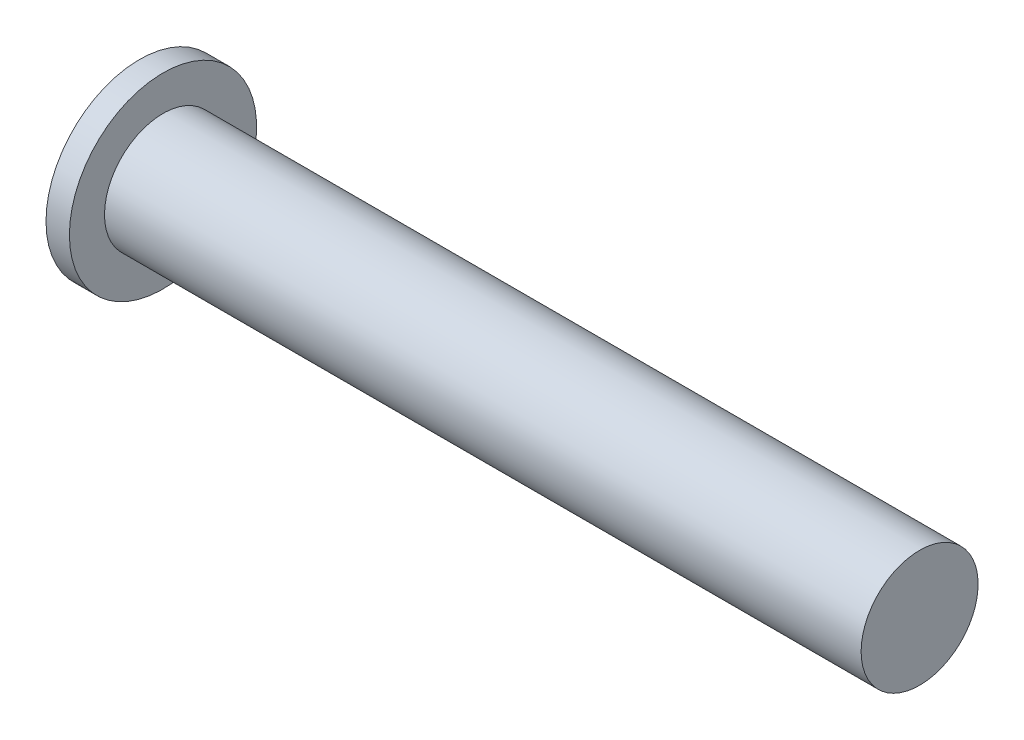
from build123d import *


with BuildPart() as part:
    # Sketch1 → Revolve1 (revolve)
    with BuildSketch(Plane.XY, mode=Mode.PRIVATE) as revolve1_sk:
        Polygon((0, 0), (0, 4.8768), (1.2192, 4.8768), (1.2192, 3.048), (40.64, 3.048), (40.64, 0), align=None)
    revolve(revolve1_sk.sketch.rotate(Axis((40.64, 0, 0), (-1, 0, 0)), 270), axis=Axis((40.64, 0, 0), (-1, 0, 0)))


solid = part.part
